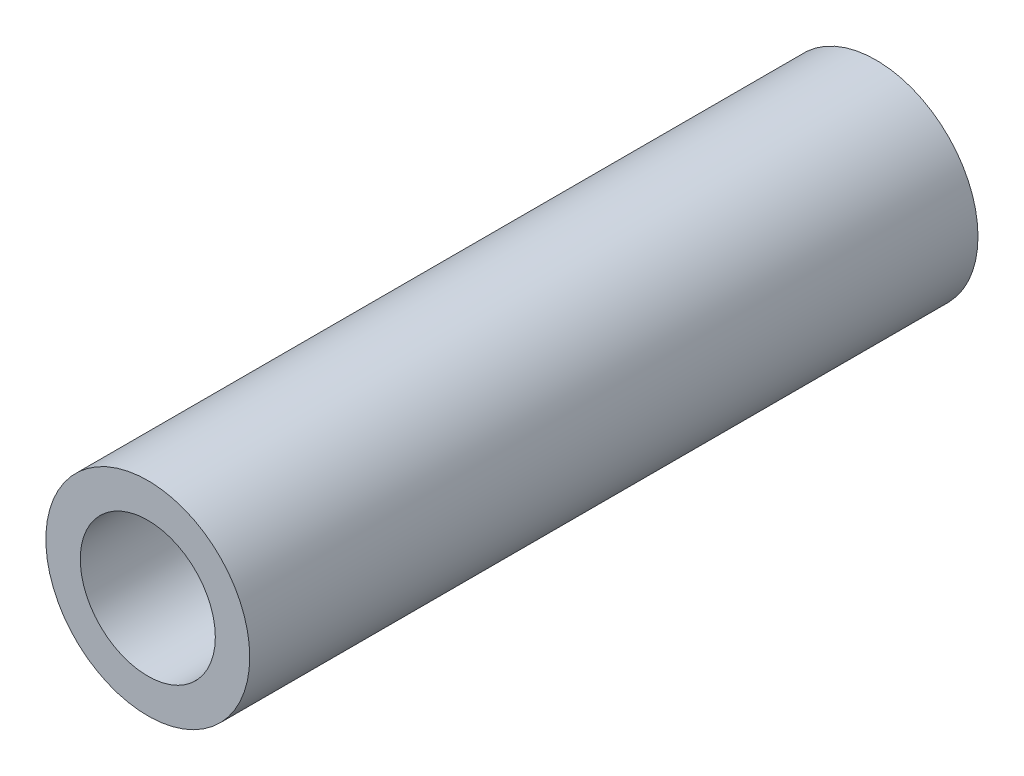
from build123d import *

# Parameters (mm, degrees)
SKETCH1_R        = 4
SKETCH1_R_2      = 2.65
EXTRUSION1_DEPTH = 28.575


with BuildPart() as part:
    # Sketch1 → Extrusion1 (new body)
    with BuildSketch(Plane.XY):
        Circle(SKETCH1_R)
        Circle(SKETCH1_R_2, mode=Mode.SUBTRACT)
    extrude(amount=EXTRUSION1_DEPTH)


solid = part.part
